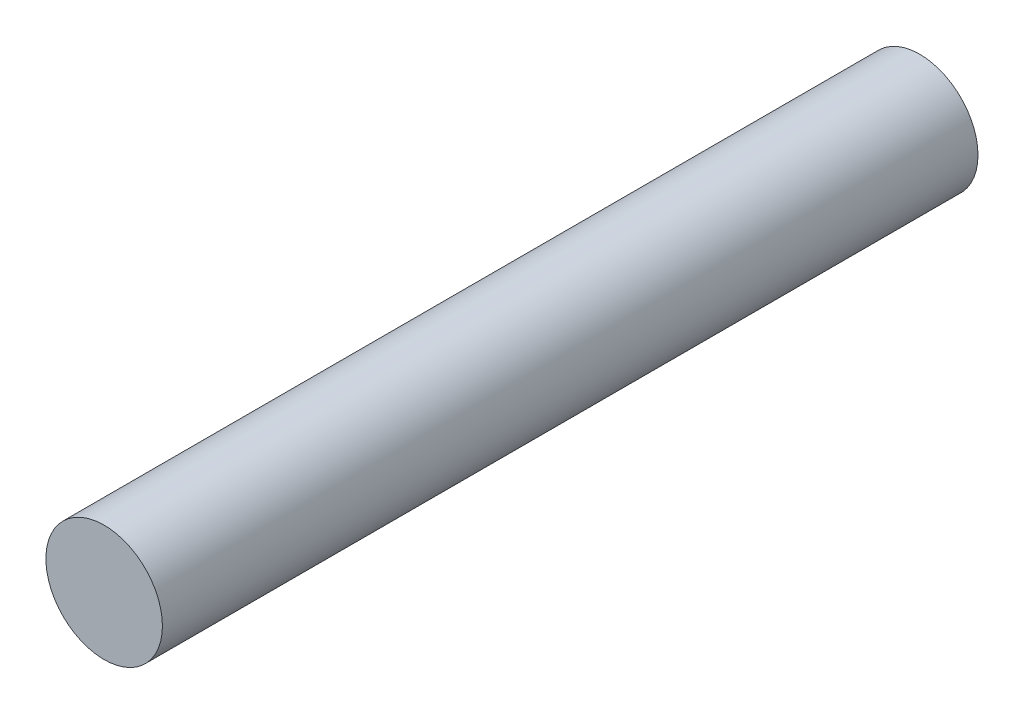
from build123d import *

# Parameters (mm, degrees)
SKETCH1_R           = 3.175
BOSS_EXTRUDE1_DEPTH = 44.45


with BuildPart() as part:
    # Sketch1 → Boss-Extrude1 (new body)
    with BuildSketch(Plane.XY):
        with Locations((-46.771964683, 18.228617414)):
            Circle(SKETCH1_R)
    extrude(amount=BOSS_EXTRUDE1_DEPTH)


solid = part.part
